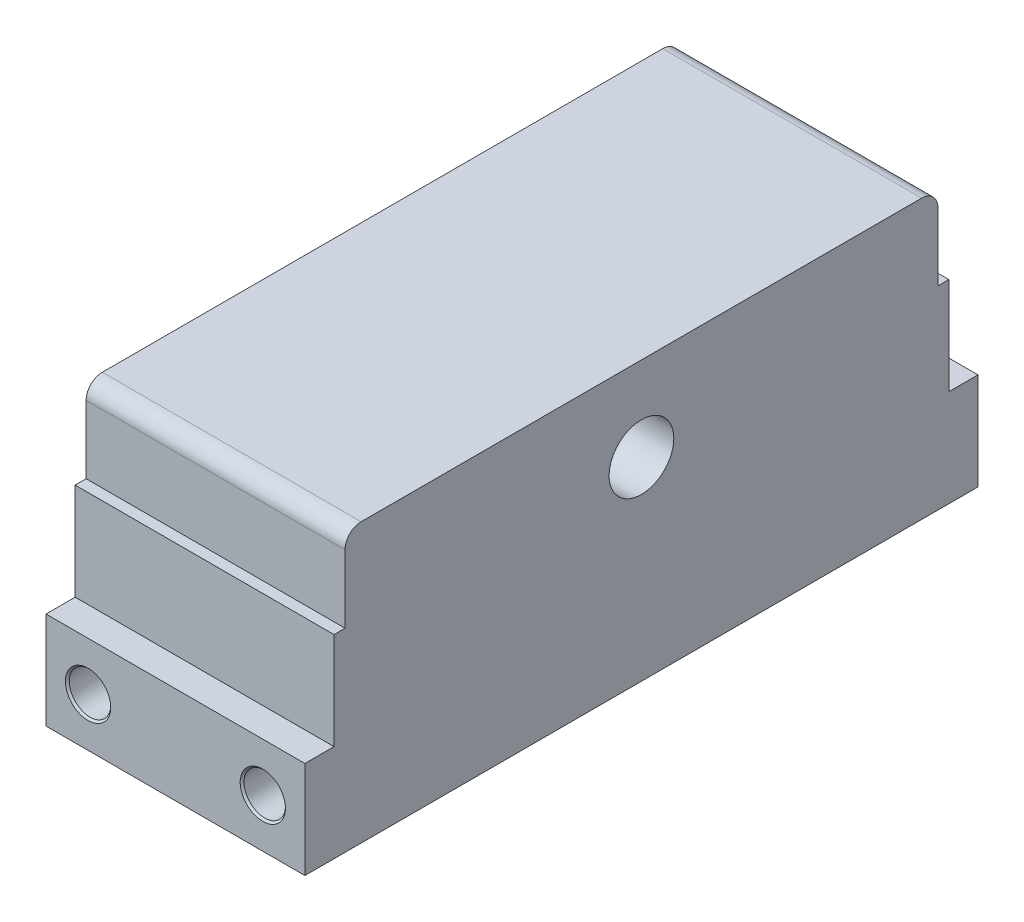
ISO-10303-21;
HEADER;
FILE_DESCRIPTION(('STEP AP214'),'2;1');
FILE_NAME('part.step','',(''),(''),'','','');
FILE_SCHEMA(('AUTOMOTIVE_DESIGN { 1 0 10303 214 1 1 1 1 }'));
ENDSEC;
DATA;
#1=APPLICATION_CONTEXT('core data for automotive mechanical design processes');
#2=APPLICATION_PROTOCOL_DEFINITION('international standard','automotive_design',2000,#1);
#3=PRODUCT_CONTEXT('',#1,'mechanical');
#4=PRODUCT('Part','Part','',(#3));
#5=PRODUCT_RELATED_PRODUCT_CATEGORY('part','',(#4));
#6=PRODUCT_DEFINITION_FORMATION('','',#4);
#7=PRODUCT_DEFINITION_CONTEXT('part definition',#1,'design');
#8=PRODUCT_DEFINITION('design','',#6,#7);
#9=PRODUCT_DEFINITION_SHAPE('','',#8);
#10=(LENGTH_UNIT() NAMED_UNIT(*) SI_UNIT(.MILLI.,.METRE.));
#11=(NAMED_UNIT(*) PLANE_ANGLE_UNIT() SI_UNIT($,.RADIAN.));
#12=(NAMED_UNIT(*) SI_UNIT($,.STERADIAN.) SOLID_ANGLE_UNIT());
#13=UNCERTAINTY_MEASURE_WITH_UNIT(LENGTH_MEASURE(1.E-05),#10,'distance_accuracy_value','');
#14=(GEOMETRIC_REPRESENTATION_CONTEXT(3) GLOBAL_UNCERTAINTY_ASSIGNED_CONTEXT((#13)) GLOBAL_UNIT_ASSIGNED_CONTEXT((#10,
#11,#12)) REPRESENTATION_CONTEXT('',''));
#15=CARTESIAN_POINT('',(0.,0.,0.));
#16=DIRECTION('',(0.,0.,1.));
#17=DIRECTION('',(1.,0.,0.));
#18=AXIS2_PLACEMENT_3D('',#15,#16,#17);
#19=CARTESIAN_POINT('',(40.,10.5,43.3000000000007));
#20=DIRECTION('',(1.,0.,0.));
#21=DIRECTION('',(0.,0.,-1.));
#22=AXIS2_PLACEMENT_3D('',#19,#20,#21);
#23=PLANE('',#22);
#24=CARTESIAN_POINT('',(40.,10.5,43.3000000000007));
#25=DIRECTION('',(1.,0.,0.));
#26=DIRECTION('',(0.,0.,-1.));
#27=AXIS2_PLACEMENT_3D('',#24,#25,#26);
#28=CIRCLE('',#27,2.49999999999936);
#29=CARTESIAN_POINT('',(40.,12.9999999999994,43.3000000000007));
#30=VERTEX_POINT('',#29);
#31=CARTESIAN_POINT('',(40.,10.5,45.8));
#32=VERTEX_POINT('',#31);
#33=EDGE_CURVE('E197',#30,#32,#28,.T.);
#34=ORIENTED_EDGE('',*,*,#33,.T.);
#35=DIRECTION('',(0.,-1.,0.));
#36=VECTOR('',#35,1.);
#37=CARTESIAN_POINT('',(40.,10.5,45.8));
#38=LINE('',#37,#36);
#39=CARTESIAN_POINT('',(40.,0.,45.8));
#40=VERTEX_POINT('',#39);
#41=EDGE_CURVE('E109',#32,#40,#38,.T.);
#42=ORIENTED_EDGE('',*,*,#41,.T.);
#43=DIRECTION('',(0.,0.,1.));
#44=VECTOR('',#43,1.);
#45=CARTESIAN_POINT('',(40.,0.,45.8));
#46=LINE('',#45,#44);
#47=CARTESIAN_POINT('',(40.,0.,47.5));
#48=VERTEX_POINT('',#47);
#49=EDGE_CURVE('E230',#40,#48,#46,.T.);
#50=ORIENTED_EDGE('',*,*,#49,.T.);
#51=DIRECTION('',(0.,-1.,0.));
#52=VECTOR('',#51,1.);
#53=CARTESIAN_POINT('',(40.,0.,47.5));
#54=LINE('',#53,#52);
#55=CARTESIAN_POINT('',(40.,-14.9999999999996,47.5));
#56=VERTEX_POINT('',#55);
#57=EDGE_CURVE('E247',#48,#56,#54,.T.);
#58=ORIENTED_EDGE('',*,*,#57,.T.);
#59=DIRECTION('',(0.,0.,1.));
#60=VECTOR('',#59,1.);
#61=CARTESIAN_POINT('',(40.,-14.9999999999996,47.5));
#62=LINE('',#61,#60);
#63=CARTESIAN_POINT('',(40.,-14.9999999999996,52.));
#64=VERTEX_POINT('',#63);
#65=EDGE_CURVE('E244',#56,#64,#62,.T.);
#66=ORIENTED_EDGE('',*,*,#65,.T.);
#67=DIRECTION('',(0.,-1.,0.));
#68=VECTOR('',#67,1.);
#69=CARTESIAN_POINT('',(40.,-14.9999999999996,52.));
#70=LINE('',#69,#68);
#71=CARTESIAN_POINT('',(40.,-30.0000000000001,52.));
#72=VERTEX_POINT('',#71);
#73=EDGE_CURVE('E246',#64,#72,#70,.T.);
#74=ORIENTED_EDGE('',*,*,#73,.T.);
#75=DIRECTION('',(0.,0.,-1.));
#76=VECTOR('',#75,1.);
#77=CARTESIAN_POINT('',(40.,-30.0000000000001,52.));
#78=LINE('',#77,#76);
#79=CARTESIAN_POINT('',(40.,-30.,-52.));
#80=VERTEX_POINT('',#79);
#81=EDGE_CURVE('E249',#72,#80,#78,.T.);
#82=ORIENTED_EDGE('',*,*,#81,.T.);
#83=DIRECTION('',(0.,1.,0.));
#84=VECTOR('',#83,1.);
#85=CARTESIAN_POINT('',(40.,-30.,-52.));
#86=LINE('',#85,#84);
#87=CARTESIAN_POINT('',(40.,-15.0000000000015,-52.));
#88=VERTEX_POINT('',#87);
#89=EDGE_CURVE('E255',#80,#88,#86,.T.);
#90=ORIENTED_EDGE('',*,*,#89,.T.);
#91=DIRECTION('',(0.,0.,1.));
#92=VECTOR('',#91,1.);
#93=CARTESIAN_POINT('',(40.,-15.0000000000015,-52.));
#94=LINE('',#93,#92);
#95=CARTESIAN_POINT('',(40.,-15.0000000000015,-47.5000000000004));
#96=VERTEX_POINT('',#95);
#97=EDGE_CURVE('E257',#88,#96,#94,.T.);
#98=ORIENTED_EDGE('',*,*,#97,.T.);
#99=DIRECTION('',(0.,1.,0.));
#100=VECTOR('',#99,1.);
#101=CARTESIAN_POINT('',(40.,-15.0000000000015,-47.5000000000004));
#102=LINE('',#101,#100);
#103=CARTESIAN_POINT('',(40.,-2.46830331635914E-12,-47.5000000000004));
#104=VERTEX_POINT('',#103);
#105=EDGE_CURVE('E259',#96,#104,#102,.T.);
#106=ORIENTED_EDGE('',*,*,#105,.T.);
#107=DIRECTION('',(0.,0.,1.));
#108=VECTOR('',#107,1.);
#109=CARTESIAN_POINT('',(40.,-2.46830331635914E-12,-47.5000000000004));
#110=LINE('',#109,#108);
#111=CARTESIAN_POINT('',(40.,-2.468511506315E-12,-45.8000000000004));
#112=VERTEX_POINT('',#111);
#113=EDGE_CURVE('E149',#104,#112,#110,.T.);
#114=ORIENTED_EDGE('',*,*,#113,.T.);
#115=DIRECTION('',(0.,1.,0.));
#116=VECTOR('',#115,1.);
#117=CARTESIAN_POINT('',(40.,-2.468511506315E-12,-45.8000000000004));
#118=LINE('',#117,#116);
#119=CARTESIAN_POINT('',(40.,10.4999999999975,-45.8000000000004));
#120=VERTEX_POINT('',#119);
#121=EDGE_CURVE('E142',#112,#120,#118,.T.);
#122=ORIENTED_EDGE('',*,*,#121,.T.);
#123=CARTESIAN_POINT('',(40.,10.4999999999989,-43.3));
#124=DIRECTION('',(1.,0.,0.));
#125=DIRECTION('',(0.,0.,1.));
#126=AXIS2_PLACEMENT_3D('',#123,#124,#125);
#127=CIRCLE('',#126,2.50000000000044);
#128=CARTESIAN_POINT('',(40.,12.9999999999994,-43.3));
#129=VERTEX_POINT('',#128);
#130=EDGE_CURVE('E146',#120,#129,#127,.T.);
#131=ORIENTED_EDGE('',*,*,#130,.T.);
#132=DIRECTION('',(0.,0.,1.));
#133=VECTOR('',#132,1.);
#134=CARTESIAN_POINT('',(40.,12.9999999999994,-43.3));
#135=LINE('',#134,#133);
#136=EDGE_CURVE('E49',#129,#30,#135,.T.);
#137=ORIENTED_EDGE('',*,*,#136,.T.);
#138=EDGE_LOOP('',(#34,#42,#50,#58,#66,#74,#82,#90,#98,#106,#114,#122,#131,#137));
#139=FACE_BOUND('',#138,.T.);
#140=CARTESIAN_POINT('',(40.,0.,0.));
#141=DIRECTION('',(1.,0.,0.));
#142=DIRECTION('',(0.,0.,-1.));
#143=AXIS2_PLACEMENT_3D('',#140,#141,#142);
#144=CIRCLE('',#143,4.99999999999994);
#145=CARTESIAN_POINT('',(40.,0.,-4.99999999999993));
#146=VERTEX_POINT('',#145);
#147=EDGE_CURVE('E173',#146,#146,#144,.T.);
#148=ORIENTED_EDGE('',*,*,#147,.F.);
#149=EDGE_LOOP('',(#148));
#150=FACE_BOUND('',#149,.T.);
#151=ADVANCED_FACE('F32',(#139,#150),#23,.T.);
#152=CARTESIAN_POINT('',(0.,10.5,43.3000000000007));
#153=DIRECTION('',(1.,0.,0.));
#154=DIRECTION('',(0.,0.,-1.));
#155=AXIS2_PLACEMENT_3D('',#152,#153,#154);
#156=PLANE('',#155);
#157=CARTESIAN_POINT('',(0.,10.5,43.3000000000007));
#158=DIRECTION('',(1.,0.,0.));
#159=DIRECTION('',(0.,0.,-1.));
#160=AXIS2_PLACEMENT_3D('',#157,#158,#159);
#161=CIRCLE('',#160,2.49999999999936);
#162=CARTESIAN_POINT('',(0.,12.9999999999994,43.3000000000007));
#163=VERTEX_POINT('',#162);
#164=CARTESIAN_POINT('',(0.,10.5,45.8));
#165=VERTEX_POINT('',#164);
#166=EDGE_CURVE('E169',#163,#165,#161,.T.);
#167=ORIENTED_EDGE('',*,*,#166,.F.);
#168=DIRECTION('',(0.,0.,1.));
#169=VECTOR('',#168,1.);
#170=CARTESIAN_POINT('',(0.,12.9999999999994,0.));
#171=LINE('',#170,#169);
#172=CARTESIAN_POINT('',(0.,12.9999999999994,-43.3));
#173=VERTEX_POINT('',#172);
#174=EDGE_CURVE('E97',#173,#163,#171,.T.);
#175=ORIENTED_EDGE('',*,*,#174,.F.);
#176=CARTESIAN_POINT('',(0.,10.4999999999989,-43.3));
#177=DIRECTION('',(1.,0.,0.));
#178=DIRECTION('',(0.,0.,1.));
#179=AXIS2_PLACEMENT_3D('',#176,#177,#178);
#180=CIRCLE('',#179,2.50000000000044);
#181=CARTESIAN_POINT('',(0.,10.4999999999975,-45.8000000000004));
#182=VERTEX_POINT('',#181);
#183=EDGE_CURVE('E194',#182,#173,#180,.T.);
#184=ORIENTED_EDGE('',*,*,#183,.F.);
#185=DIRECTION('',(0.,1.,0.));
#186=VECTOR('',#185,1.);
#187=CARTESIAN_POINT('',(0.,-2.468511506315E-12,-45.8000000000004));
#188=LINE('',#187,#186);
#189=CARTESIAN_POINT('',(0.,-2.468511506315E-12,-45.8000000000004));
#190=VERTEX_POINT('',#189);
#191=EDGE_CURVE('E158',#190,#182,#188,.T.);
#192=ORIENTED_EDGE('',*,*,#191,.F.);
#193=DIRECTION('',(0.,0.,1.));
#194=VECTOR('',#193,1.);
#195=CARTESIAN_POINT('',(0.,-2.46830331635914E-12,-47.5000000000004));
#196=LINE('',#195,#194);
#197=CARTESIAN_POINT('',(0.,-2.46830331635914E-12,-47.5000000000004));
#198=VERTEX_POINT('',#197);
#199=EDGE_CURVE('E191',#198,#190,#196,.T.);
#200=ORIENTED_EDGE('',*,*,#199,.F.);
#201=DIRECTION('',(0.,1.,0.));
#202=VECTOR('',#201,1.);
#203=CARTESIAN_POINT('',(0.,-15.0000000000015,-47.5000000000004));
#204=LINE('',#203,#202);
#205=CARTESIAN_POINT('',(0.,-15.0000000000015,-47.5000000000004));
#206=VERTEX_POINT('',#205);
#207=EDGE_CURVE('E189',#206,#198,#204,.T.);
#208=ORIENTED_EDGE('',*,*,#207,.F.);
#209=DIRECTION('',(0.,0.,1.));
#210=VECTOR('',#209,1.);
#211=CARTESIAN_POINT('',(0.,-15.0000000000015,-52.));
#212=LINE('',#211,#210);
#213=CARTESIAN_POINT('',(0.,-15.0000000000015,-52.));
#214=VERTEX_POINT('',#213);
#215=EDGE_CURVE('E187',#214,#206,#212,.T.);
#216=ORIENTED_EDGE('',*,*,#215,.F.);
#217=DIRECTION('',(0.,1.,0.));
#218=VECTOR('',#217,1.);
#219=CARTESIAN_POINT('',(0.,-30.,-52.));
#220=LINE('',#219,#218);
#221=CARTESIAN_POINT('',(0.,-30.,-52.));
#222=VERTEX_POINT('',#221);
#223=EDGE_CURVE('E185',#222,#214,#220,.T.);
#224=ORIENTED_EDGE('',*,*,#223,.F.);
#225=DIRECTION('',(0.,0.,-1.));
#226=VECTOR('',#225,1.);
#227=CARTESIAN_POINT('',(0.,-30.0000000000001,52.));
#228=LINE('',#227,#226);
#229=CARTESIAN_POINT('',(0.,-30.0000000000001,52.));
#230=VERTEX_POINT('',#229);
#231=EDGE_CURVE('E183',#230,#222,#228,.T.);
#232=ORIENTED_EDGE('',*,*,#231,.F.);
#233=DIRECTION('',(0.,-1.,0.));
#234=VECTOR('',#233,1.);
#235=CARTESIAN_POINT('',(0.,-14.9999999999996,52.));
#236=LINE('',#235,#234);
#237=CARTESIAN_POINT('',(0.,-14.9999999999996,52.));
#238=VERTEX_POINT('',#237);
#239=EDGE_CURVE('E181',#238,#230,#236,.T.);
#240=ORIENTED_EDGE('',*,*,#239,.F.);
#241=DIRECTION('',(0.,0.,1.));
#242=VECTOR('',#241,1.);
#243=CARTESIAN_POINT('',(0.,-14.9999999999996,47.5));
#244=LINE('',#243,#242);
#245=CARTESIAN_POINT('',(0.,-14.9999999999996,47.5));
#246=VERTEX_POINT('',#245);
#247=EDGE_CURVE('E179',#246,#238,#244,.T.);
#248=ORIENTED_EDGE('',*,*,#247,.F.);
#249=DIRECTION('',(0.,-1.,0.));
#250=VECTOR('',#249,1.);
#251=CARTESIAN_POINT('',(0.,0.,47.5));
#252=LINE('',#251,#250);
#253=CARTESIAN_POINT('',(0.,0.,47.5));
#254=VERTEX_POINT('',#253);
#255=EDGE_CURVE('E177',#254,#246,#252,.T.);
#256=ORIENTED_EDGE('',*,*,#255,.F.);
#257=DIRECTION('',(0.,0.,1.));
#258=VECTOR('',#257,1.);
#259=CARTESIAN_POINT('',(0.,0.,45.8));
#260=LINE('',#259,#258);
#261=CARTESIAN_POINT('',(0.,0.,45.8));
#262=VERTEX_POINT('',#261);
#263=EDGE_CURVE('E175',#262,#254,#260,.T.);
#264=ORIENTED_EDGE('',*,*,#263,.F.);
#265=DIRECTION('',(0.,-1.,0.));
#266=VECTOR('',#265,1.);
#267=CARTESIAN_POINT('',(0.,10.5,45.8));
#268=LINE('',#267,#266);
#269=EDGE_CURVE('E172',#165,#262,#268,.T.);
#270=ORIENTED_EDGE('',*,*,#269,.F.);
#271=EDGE_LOOP('',(#167,#175,#184,#192,#200,#208,#216,#224,#232,#240,#248,#256,#264,#270));
#272=FACE_BOUND('',#271,.T.);
#273=CARTESIAN_POINT('',(0.,0.,0.));
#274=DIRECTION('',(1.,0.,0.));
#275=DIRECTION('',(0.,0.,-1.));
#276=AXIS2_PLACEMENT_3D('',#273,#274,#275);
#277=CIRCLE('',#276,4.99999999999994);
#278=CARTESIAN_POINT('',(0.,0.,-4.99999999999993));
#279=VERTEX_POINT('',#278);
#280=EDGE_CURVE('E277',#279,#279,#277,.T.);
#281=ORIENTED_EDGE('',*,*,#280,.T.);
#282=EDGE_LOOP('',(#281));
#283=FACE_BOUND('',#282,.T.);
#284=ADVANCED_FACE('F232',(#272,#283),#156,.F.);
#285=CARTESIAN_POINT('',(40.,10.5,43.3000000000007));
#286=DIRECTION('',(-1.,0.,0.));
#287=DIRECTION('',(0.,0.,1.));
#288=AXIS2_PLACEMENT_3D('',#285,#286,#287);
#289=CYLINDRICAL_SURFACE('',#288,2.49999999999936);
#290=ORIENTED_EDGE('',*,*,#166,.T.);
#291=DIRECTION('',(-1.,0.,0.));
#292=VECTOR('',#291,1.);
#293=CARTESIAN_POINT('',(40.,10.5,45.8));
#294=LINE('',#293,#292);
#295=EDGE_CURVE('E11',#32,#165,#294,.T.);
#296=ORIENTED_EDGE('',*,*,#295,.F.);
#297=ORIENTED_EDGE('',*,*,#33,.F.);
#298=DIRECTION('',(-1.,0.,0.));
#299=VECTOR('',#298,1.);
#300=CARTESIAN_POINT('',(40.,12.9999999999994,43.3000000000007));
#301=LINE('',#300,#299);
#302=EDGE_CURVE('E165',#30,#163,#301,.T.);
#303=ORIENTED_EDGE('',*,*,#302,.T.);
#304=EDGE_LOOP('',(#290,#296,#297,#303));
#305=FACE_BOUND('',#304,.T.);
#306=ADVANCED_FACE('F34',(#305),#289,.T.);
#307=CARTESIAN_POINT('',(40.,10.5,45.8));
#308=DIRECTION('',(0.,0.,-1.));
#309=DIRECTION('',(-1.,0.,0.));
#310=AXIS2_PLACEMENT_3D('',#307,#308,#309);
#311=PLANE('',#310);
#312=ORIENTED_EDGE('',*,*,#269,.T.);
#313=DIRECTION('',(-1.,0.,0.));
#314=VECTOR('',#313,1.);
#315=CARTESIAN_POINT('',(40.,0.,45.8));
#316=LINE('',#315,#314);
#317=EDGE_CURVE('E41',#40,#262,#316,.T.);
#318=ORIENTED_EDGE('',*,*,#317,.F.);
#319=ORIENTED_EDGE('',*,*,#41,.F.);
#320=ORIENTED_EDGE('',*,*,#295,.T.);
#321=EDGE_LOOP('',(#312,#318,#319,#320));
#322=FACE_BOUND('',#321,.T.);
#323=ADVANCED_FACE('F564',(#322),#311,.F.);
#324=CARTESIAN_POINT('',(40.,0.,45.8));
#325=DIRECTION('',(0.,-1.,0.));
#326=DIRECTION('',(0.,0.,-1.));
#327=AXIS2_PLACEMENT_3D('',#324,#325,#326);
#328=PLANE('',#327);
#329=ORIENTED_EDGE('',*,*,#263,.T.);
#330=DIRECTION('',(-1.,0.,0.));
#331=VECTOR('',#330,1.);
#332=CARTESIAN_POINT('',(40.,0.,47.5));
#333=LINE('',#332,#331);
#334=EDGE_CURVE('E222',#48,#254,#333,.T.);
#335=ORIENTED_EDGE('',*,*,#334,.F.);
#336=ORIENTED_EDGE('',*,*,#49,.F.);
#337=ORIENTED_EDGE('',*,*,#317,.T.);
#338=EDGE_LOOP('',(#329,#335,#336,#337));
#339=FACE_BOUND('',#338,.T.);
#340=ADVANCED_FACE('F228',(#339),#328,.F.);
#341=CARTESIAN_POINT('',(40.,0.,47.5));
#342=DIRECTION('',(0.,0.,-1.));
#343=DIRECTION('',(0.,1.,0.));
#344=AXIS2_PLACEMENT_3D('',#341,#342,#343);
#345=PLANE('',#344);
#346=ORIENTED_EDGE('',*,*,#255,.T.);
#347=DIRECTION('',(-1.,0.,0.));
#348=VECTOR('',#347,1.);
#349=CARTESIAN_POINT('',(40.,-14.9999999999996,47.5));
#350=LINE('',#349,#348);
#351=EDGE_CURVE('E219',#56,#246,#350,.T.);
#352=ORIENTED_EDGE('',*,*,#351,.F.);
#353=ORIENTED_EDGE('',*,*,#57,.F.);
#354=ORIENTED_EDGE('',*,*,#334,.T.);
#355=EDGE_LOOP('',(#346,#352,#353,#354));
#356=FACE_BOUND('',#355,.T.);
#357=ADVANCED_FACE('F238',(#356),#345,.F.);
#358=CARTESIAN_POINT('',(40.,-14.9999999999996,47.5));
#359=DIRECTION('',(0.,-1.,0.));
#360=DIRECTION('',(0.,0.,-1.));
#361=AXIS2_PLACEMENT_3D('',#358,#359,#360);
#362=PLANE('',#361);
#363=ORIENTED_EDGE('',*,*,#247,.T.);
#364=DIRECTION('',(-1.,0.,0.));
#365=VECTOR('',#364,1.);
#366=CARTESIAN_POINT('',(40.,-14.9999999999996,52.));
#367=LINE('',#366,#365);
#368=EDGE_CURVE('E216',#64,#238,#367,.T.);
#369=ORIENTED_EDGE('',*,*,#368,.F.);
#370=ORIENTED_EDGE('',*,*,#65,.F.);
#371=ORIENTED_EDGE('',*,*,#351,.T.);
#372=EDGE_LOOP('',(#363,#369,#370,#371));
#373=FACE_BOUND('',#372,.T.);
#374=ADVANCED_FACE('F242',(#373),#362,.F.);
#375=CARTESIAN_POINT('',(40.,-14.9999999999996,52.));
#376=DIRECTION('',(0.,0.,-1.));
#377=DIRECTION('',(0.,1.,0.));
#378=AXIS2_PLACEMENT_3D('',#375,#376,#377);
#379=PLANE('',#378);
#380=CARTESIAN_POINT('',(6.5,-22.5,52.));
#381=DIRECTION('',(0.,0.,1.));
#382=DIRECTION('',(0.,-1.,0.));
#383=AXIS2_PLACEMENT_3D('',#380,#381,#382);
#384=CIRCLE('',#383,3.5);
#385=CARTESIAN_POINT('',(6.5,-26.,52.));
#386=VERTEX_POINT('',#385);
#387=EDGE_CURVE('E297',#386,#386,#384,.T.);
#388=ORIENTED_EDGE('',*,*,#387,.F.);
#389=EDGE_LOOP('',(#388));
#390=FACE_BOUND('',#389,.T.);
#391=CARTESIAN_POINT('',(33.5,-22.5,52.));
#392=DIRECTION('',(0.,0.,1.));
#393=DIRECTION('',(0.,-1.,0.));
#394=AXIS2_PLACEMENT_3D('',#391,#392,#393);
#395=CIRCLE('',#394,3.5);
#396=CARTESIAN_POINT('',(33.5,-26.,52.));
#397=VERTEX_POINT('',#396);
#398=EDGE_CURVE('E288',#397,#397,#395,.T.);
#399=ORIENTED_EDGE('',*,*,#398,.F.);
#400=EDGE_LOOP('',(#399));
#401=FACE_BOUND('',#400,.T.);
#402=ORIENTED_EDGE('',*,*,#239,.T.);
#403=DIRECTION('',(-1.,0.,0.));
#404=VECTOR('',#403,1.);
#405=CARTESIAN_POINT('',(40.,-30.0000000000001,52.));
#406=LINE('',#405,#404);
#407=EDGE_CURVE('E213',#72,#230,#406,.T.);
#408=ORIENTED_EDGE('',*,*,#407,.F.);
#409=ORIENTED_EDGE('',*,*,#73,.F.);
#410=ORIENTED_EDGE('',*,*,#368,.T.);
#411=EDGE_LOOP('',(#402,#408,#409,#410));
#412=FACE_BOUND('',#411,.T.);
#413=ADVANCED_FACE('F534',(#390,#401,#412),#379,.F.);
#414=CARTESIAN_POINT('',(40.,-30.0000000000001,52.));
#415=DIRECTION('',(0.,1.,0.));
#416=DIRECTION('',(0.,0.,1.));
#417=AXIS2_PLACEMENT_3D('',#414,#415,#416);
#418=PLANE('',#417);
#419=ORIENTED_EDGE('',*,*,#231,.T.);
#420=DIRECTION('',(-1.,0.,0.));
#421=VECTOR('',#420,1.);
#422=CARTESIAN_POINT('',(40.,-30.,-52.));
#423=LINE('',#422,#421);
#424=EDGE_CURVE('E210',#80,#222,#423,.T.);
#425=ORIENTED_EDGE('',*,*,#424,.F.);
#426=ORIENTED_EDGE('',*,*,#81,.F.);
#427=ORIENTED_EDGE('',*,*,#407,.T.);
#428=EDGE_LOOP('',(#419,#425,#426,#427));
#429=FACE_BOUND('',#428,.T.);
#430=ADVANCED_FACE('F325',(#429),#418,.F.);
#431=CARTESIAN_POINT('',(40.,-30.,-52.));
#432=DIRECTION('',(0.,0.,1.));
#433=DIRECTION('',(0.,-1.,0.));
#434=AXIS2_PLACEMENT_3D('',#431,#432,#433);
#435=PLANE('',#434);
#436=CARTESIAN_POINT('',(6.5,-22.5,-52.));
#437=DIRECTION('',(0.,0.,-1.));
#438=DIRECTION('',(-1.,0.,0.));
#439=AXIS2_PLACEMENT_3D('',#436,#437,#438);
#440=CIRCLE('',#439,3.5);
#441=CARTESIAN_POINT('',(3.,-22.5,-52.));
#442=VERTEX_POINT('',#441);
#443=EDGE_CURVE('E315',#442,#442,#440,.T.);
#444=ORIENTED_EDGE('',*,*,#443,.F.);
#445=EDGE_LOOP('',(#444));
#446=FACE_BOUND('',#445,.T.);
#447=CARTESIAN_POINT('',(33.5,-22.5,-52.));
#448=DIRECTION('',(0.,0.,-1.));
#449=DIRECTION('',(-1.,0.,0.));
#450=AXIS2_PLACEMENT_3D('',#447,#448,#449);
#451=CIRCLE('',#450,3.5);
#452=CARTESIAN_POINT('',(30.,-22.5,-52.));
#453=VERTEX_POINT('',#452);
#454=EDGE_CURVE('E306',#453,#453,#451,.T.);
#455=ORIENTED_EDGE('',*,*,#454,.F.);
#456=EDGE_LOOP('',(#455));
#457=FACE_BOUND('',#456,.T.);
#458=ORIENTED_EDGE('',*,*,#223,.T.);
#459=DIRECTION('',(-1.,0.,0.));
#460=VECTOR('',#459,1.);
#461=CARTESIAN_POINT('',(40.,-15.0000000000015,-52.));
#462=LINE('',#461,#460);
#463=EDGE_CURVE('E207',#88,#214,#462,.T.);
#464=ORIENTED_EDGE('',*,*,#463,.F.);
#465=ORIENTED_EDGE('',*,*,#89,.F.);
#466=ORIENTED_EDGE('',*,*,#424,.T.);
#467=EDGE_LOOP('',(#458,#464,#465,#466));
#468=FACE_BOUND('',#467,.T.);
#469=ADVANCED_FACE('F321',(#446,#457,#468),#435,.F.);
#470=CARTESIAN_POINT('',(40.,-15.0000000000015,-52.));
#471=DIRECTION('',(0.,-1.,0.));
#472=DIRECTION('',(0.,0.,-1.));
#473=AXIS2_PLACEMENT_3D('',#470,#471,#472);
#474=PLANE('',#473);
#475=ORIENTED_EDGE('',*,*,#215,.T.);
#476=DIRECTION('',(-1.,0.,0.));
#477=VECTOR('',#476,1.);
#478=CARTESIAN_POINT('',(40.,-15.0000000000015,-47.5000000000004));
#479=LINE('',#478,#477);
#480=EDGE_CURVE('E204',#96,#206,#479,.T.);
#481=ORIENTED_EDGE('',*,*,#480,.F.);
#482=ORIENTED_EDGE('',*,*,#97,.F.);
#483=ORIENTED_EDGE('',*,*,#463,.T.);
#484=EDGE_LOOP('',(#475,#481,#482,#483));
#485=FACE_BOUND('',#484,.T.);
#486=ADVANCED_FACE('F324',(#485),#474,.F.);
#487=CARTESIAN_POINT('',(40.,-15.0000000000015,-47.5000000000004));
#488=DIRECTION('',(0.,0.,1.));
#489=DIRECTION('',(1.,0.,0.));
#490=AXIS2_PLACEMENT_3D('',#487,#488,#489);
#491=PLANE('',#490);
#492=ORIENTED_EDGE('',*,*,#207,.T.);
#493=DIRECTION('',(-1.,0.,0.));
#494=VECTOR('',#493,1.);
#495=CARTESIAN_POINT('',(40.,-2.46830331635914E-12,-47.5000000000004));
#496=LINE('',#495,#494);
#497=EDGE_CURVE('E201',#104,#198,#496,.T.);
#498=ORIENTED_EDGE('',*,*,#497,.F.);
#499=ORIENTED_EDGE('',*,*,#105,.F.);
#500=ORIENTED_EDGE('',*,*,#480,.T.);
#501=EDGE_LOOP('',(#492,#498,#499,#500));
#502=FACE_BOUND('',#501,.T.);
#503=ADVANCED_FACE('F265',(#502),#491,.F.);
#504=CARTESIAN_POINT('',(40.,-2.46830331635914E-12,-47.5000000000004));
#505=DIRECTION('',(0.,-1.,0.));
#506=DIRECTION('',(0.,0.,-1.));
#507=AXIS2_PLACEMENT_3D('',#504,#505,#506);
#508=PLANE('',#507);
#509=ORIENTED_EDGE('',*,*,#199,.T.);
#510=DIRECTION('',(-1.,0.,0.));
#511=VECTOR('',#510,1.);
#512=CARTESIAN_POINT('',(40.,-2.468511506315E-12,-45.8000000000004));
#513=LINE('',#512,#511);
#514=EDGE_CURVE('E160',#112,#190,#513,.T.);
#515=ORIENTED_EDGE('',*,*,#514,.F.);
#516=ORIENTED_EDGE('',*,*,#113,.F.);
#517=ORIENTED_EDGE('',*,*,#497,.T.);
#518=EDGE_LOOP('',(#509,#515,#516,#517));
#519=FACE_BOUND('',#518,.T.);
#520=ADVANCED_FACE('F269',(#519),#508,.F.);
#521=CARTESIAN_POINT('',(40.,-2.468511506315E-12,-45.8000000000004));
#522=DIRECTION('',(0.,0.,1.));
#523=DIRECTION('',(1.,0.,0.));
#524=AXIS2_PLACEMENT_3D('',#521,#522,#523);
#525=PLANE('',#524);
#526=ORIENTED_EDGE('',*,*,#191,.T.);
#527=DIRECTION('',(-1.,0.,0.));
#528=VECTOR('',#527,1.);
#529=CARTESIAN_POINT('',(40.,10.4999999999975,-45.8000000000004));
#530=LINE('',#529,#528);
#531=EDGE_CURVE('E155',#120,#182,#530,.T.);
#532=ORIENTED_EDGE('',*,*,#531,.F.);
#533=ORIENTED_EDGE('',*,*,#121,.F.);
#534=ORIENTED_EDGE('',*,*,#514,.T.);
#535=EDGE_LOOP('',(#526,#532,#533,#534));
#536=FACE_BOUND('',#535,.T.);
#537=ADVANCED_FACE('F156',(#536),#525,.F.);
#538=CARTESIAN_POINT('',(40.,10.4999999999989,-43.3));
#539=DIRECTION('',(-1.,0.,0.));
#540=DIRECTION('',(0.,0.,1.));
#541=AXIS2_PLACEMENT_3D('',#538,#539,#540);
#542=CYLINDRICAL_SURFACE('',#541,2.50000000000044);
#543=ORIENTED_EDGE('',*,*,#183,.T.);
#544=DIRECTION('',(-1.,0.,0.));
#545=VECTOR('',#544,1.);
#546=CARTESIAN_POINT('',(40.,12.9999999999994,-43.3));
#547=LINE('',#546,#545);
#548=EDGE_CURVE('E161',#129,#173,#547,.T.);
#549=ORIENTED_EDGE('',*,*,#548,.F.);
#550=ORIENTED_EDGE('',*,*,#130,.F.);
#551=ORIENTED_EDGE('',*,*,#531,.T.);
#552=EDGE_LOOP('',(#543,#549,#550,#551));
#553=FACE_BOUND('',#552,.T.);
#554=ADVANCED_FACE('F163',(#553),#542,.T.);
#555=CARTESIAN_POINT('',(40.,12.9999999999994,0.));
#556=DIRECTION('',(0.,-1.,0.));
#557=DIRECTION('',(0.,0.,-1.));
#558=AXIS2_PLACEMENT_3D('',#555,#556,#557);
#559=PLANE('',#558);
#560=ORIENTED_EDGE('',*,*,#174,.T.);
#561=ORIENTED_EDGE('',*,*,#302,.F.);
#562=ORIENTED_EDGE('',*,*,#136,.F.);
#563=ORIENTED_EDGE('',*,*,#548,.T.);
#564=EDGE_LOOP('',(#560,#561,#562,#563));
#565=FACE_BOUND('',#564,.T.);
#566=ADVANCED_FACE('F270',(#565),#559,.F.);
#567=CARTESIAN_POINT('',(40.,0.,0.));
#568=DIRECTION('',(-1.,0.,0.));
#569=DIRECTION('',(0.,0.,1.));
#570=AXIS2_PLACEMENT_3D('',#567,#568,#569);
#571=CYLINDRICAL_SURFACE('',#570,4.99999999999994);
#572=ORIENTED_EDGE('',*,*,#147,.T.);
#573=EDGE_LOOP('',(#572));
#574=FACE_BOUND('',#573,.T.);
#575=ORIENTED_EDGE('',*,*,#280,.F.);
#576=EDGE_LOOP('',(#575));
#577=FACE_BOUND('',#576,.T.);
#578=ADVANCED_FACE('F349',(#574,#577),#571,.F.);
#579=CARTESIAN_POINT('',(33.5,-22.5,22.));
#580=DIRECTION('',(0.,0.,1.));
#581=DIRECTION('',(0.,-1.,0.));
#582=AXIS2_PLACEMENT_3D('',#579,#580,#581);
#583=CONICAL_SURFACE('',#582,3.19999999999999,1.02974425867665);
#584=CARTESIAN_POINT('',(33.5,-22.5,20.0772460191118));
#585=VERTEX_POINT('',#584);
#586=VERTEX_LOOP('',#585);
#587=FACE_BOUND('',#586,.T.);
#588=CARTESIAN_POINT('',(33.5,-22.5,22.));
#589=DIRECTION('',(0.,0.,1.));
#590=DIRECTION('',(0.,-1.,0.));
#591=AXIS2_PLACEMENT_3D('',#588,#589,#590);
#592=CIRCLE('',#591,3.19999999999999);
#593=CARTESIAN_POINT('',(33.5,-25.7,22.));
#594=VERTEX_POINT('',#593);
#595=EDGE_CURVE('E280',#594,#594,#592,.T.);
#596=ORIENTED_EDGE('',*,*,#595,.T.);
#597=EDGE_LOOP('',(#596));
#598=FACE_BOUND('',#597,.T.);
#599=ADVANCED_FACE('F381',(#587,#598),#583,.F.);
#600=CARTESIAN_POINT('',(33.5,-22.5,52.));
#601=DIRECTION('',(0.,0.,1.));
#602=DIRECTION('',(0.,-1.,0.));
#603=AXIS2_PLACEMENT_3D('',#600,#601,#602);
#604=CYLINDRICAL_SURFACE('',#603,3.19999999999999);
#605=ORIENTED_EDGE('',*,*,#595,.F.);
#606=EDGE_LOOP('',(#605));
#607=FACE_BOUND('',#606,.T.);
#608=CARTESIAN_POINT('',(33.5,-22.5,51.7));
#609=DIRECTION('',(0.,0.,1.));
#610=DIRECTION('',(0.,-1.,0.));
#611=AXIS2_PLACEMENT_3D('',#608,#609,#610);
#612=CIRCLE('',#611,3.19999999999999);
#613=CARTESIAN_POINT('',(33.5,-25.7,51.7));
#614=VERTEX_POINT('',#613);
#615=EDGE_CURVE('E285',#614,#614,#612,.T.);
#616=ORIENTED_EDGE('',*,*,#615,.T.);
#617=EDGE_LOOP('',(#616));
#618=FACE_BOUND('',#617,.T.);
#619=ADVANCED_FACE('F389',(#607,#618),#604,.F.);
#620=CARTESIAN_POINT('',(33.5,-22.5,52.));
#621=DIRECTION('',(0.,0.,1.));
#622=DIRECTION('',(0.,-1.,0.));
#623=AXIS2_PLACEMENT_3D('',#620,#621,#622);
#624=CONICAL_SURFACE('',#623,3.5,0.78539816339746);
#625=ORIENTED_EDGE('',*,*,#615,.F.);
#626=EDGE_LOOP('',(#625));
#627=FACE_BOUND('',#626,.T.);
#628=ORIENTED_EDGE('',*,*,#398,.T.);
#629=EDGE_LOOP('',(#628));
#630=FACE_BOUND('',#629,.T.);
#631=ADVANCED_FACE('F396',(#627,#630),#624,.F.);
#632=CARTESIAN_POINT('',(6.5,-22.5,22.));
#633=DIRECTION('',(0.,0.,1.));
#634=DIRECTION('',(0.,-1.,0.));
#635=AXIS2_PLACEMENT_3D('',#632,#633,#634);
#636=CONICAL_SURFACE('',#635,3.19999999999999,1.02974425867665);
#637=CARTESIAN_POINT('',(6.49999999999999,-22.5,20.0772460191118));
#638=VERTEX_POINT('',#637);
#639=VERTEX_LOOP('',#638);
#640=FACE_BOUND('',#639,.T.);
#641=CARTESIAN_POINT('',(6.5,-22.5,22.));
#642=DIRECTION('',(0.,0.,1.));
#643=DIRECTION('',(0.,-1.,0.));
#644=AXIS2_PLACEMENT_3D('',#641,#642,#643);
#645=CIRCLE('',#644,3.19999999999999);
#646=CARTESIAN_POINT('',(6.5,-25.7,22.));
#647=VERTEX_POINT('',#646);
#648=EDGE_CURVE('E291',#647,#647,#645,.T.);
#649=ORIENTED_EDGE('',*,*,#648,.T.);
#650=EDGE_LOOP('',(#649));
#651=FACE_BOUND('',#650,.T.);
#652=ADVANCED_FACE('F404',(#640,#651),#636,.F.);
#653=CARTESIAN_POINT('',(6.5,-22.5,52.));
#654=DIRECTION('',(0.,0.,1.));
#655=DIRECTION('',(0.,-1.,0.));
#656=AXIS2_PLACEMENT_3D('',#653,#654,#655);
#657=CYLINDRICAL_SURFACE('',#656,3.19999999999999);
#658=ORIENTED_EDGE('',*,*,#648,.F.);
#659=EDGE_LOOP('',(#658));
#660=FACE_BOUND('',#659,.T.);
#661=CARTESIAN_POINT('',(6.5,-22.5,51.7));
#662=DIRECTION('',(0.,0.,1.));
#663=DIRECTION('',(0.,-1.,0.));
#664=AXIS2_PLACEMENT_3D('',#661,#662,#663);
#665=CIRCLE('',#664,3.2);
#666=CARTESIAN_POINT('',(6.5,-25.7,51.7));
#667=VERTEX_POINT('',#666);
#668=EDGE_CURVE('E294',#667,#667,#665,.T.);
#669=ORIENTED_EDGE('',*,*,#668,.T.);
#670=EDGE_LOOP('',(#669));
#671=FACE_BOUND('',#670,.T.);
#672=ADVANCED_FACE('F412',(#660,#671),#657,.F.);
#673=CARTESIAN_POINT('',(6.5,-22.5,52.));
#674=DIRECTION('',(0.,0.,1.));
#675=DIRECTION('',(0.,-1.,0.));
#676=AXIS2_PLACEMENT_3D('',#673,#674,#675);
#677=CONICAL_SURFACE('',#676,3.5,0.785398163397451);
#678=ORIENTED_EDGE('',*,*,#668,.F.);
#679=EDGE_LOOP('',(#678));
#680=FACE_BOUND('',#679,.T.);
#681=ORIENTED_EDGE('',*,*,#387,.T.);
#682=EDGE_LOOP('',(#681));
#683=FACE_BOUND('',#682,.T.);
#684=ADVANCED_FACE('F420',(#680,#683),#677,.F.);
#685=CARTESIAN_POINT('',(33.5,-22.5,-22.));
#686=DIRECTION('',(0.,0.,-1.));
#687=DIRECTION('',(-1.,0.,0.));
#688=AXIS2_PLACEMENT_3D('',#685,#686,#687);
#689=CONICAL_SURFACE('',#688,3.19999999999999,1.02974425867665);
#690=CARTESIAN_POINT('',(33.5,-22.5,-20.0772460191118));
#691=VERTEX_POINT('',#690);
#692=VERTEX_LOOP('',#691);
#693=FACE_BOUND('',#692,.T.);
#694=CARTESIAN_POINT('',(33.5,-22.5,-22.));
#695=DIRECTION('',(0.,0.,-1.));
#696=DIRECTION('',(-1.,0.,0.));
#697=AXIS2_PLACEMENT_3D('',#694,#695,#696);
#698=CIRCLE('',#697,3.19999999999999);
#699=CARTESIAN_POINT('',(30.3,-22.5,-22.));
#700=VERTEX_POINT('',#699);
#701=EDGE_CURVE('E300',#700,#700,#698,.T.);
#702=ORIENTED_EDGE('',*,*,#701,.T.);
#703=EDGE_LOOP('',(#702));
#704=FACE_BOUND('',#703,.T.);
#705=ADVANCED_FACE('F428',(#693,#704),#689,.F.);
#706=CARTESIAN_POINT('',(33.5,-22.5,-52.));
#707=DIRECTION('',(0.,0.,-1.));
#708=DIRECTION('',(-1.,0.,0.));
#709=AXIS2_PLACEMENT_3D('',#706,#707,#708);
#710=CYLINDRICAL_SURFACE('',#709,3.19999999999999);
#711=ORIENTED_EDGE('',*,*,#701,.F.);
#712=EDGE_LOOP('',(#711));
#713=FACE_BOUND('',#712,.T.);
#714=CARTESIAN_POINT('',(33.5,-22.5,-51.7));
#715=DIRECTION('',(0.,0.,-1.));
#716=DIRECTION('',(-1.,0.,0.));
#717=AXIS2_PLACEMENT_3D('',#714,#715,#716);
#718=CIRCLE('',#717,3.19999999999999);
#719=CARTESIAN_POINT('',(30.3,-22.5,-51.7));
#720=VERTEX_POINT('',#719);
#721=EDGE_CURVE('E303',#720,#720,#718,.T.);
#722=ORIENTED_EDGE('',*,*,#721,.T.);
#723=EDGE_LOOP('',(#722));
#724=FACE_BOUND('',#723,.T.);
#725=ADVANCED_FACE('F436',(#713,#724),#710,.F.);
#726=CARTESIAN_POINT('',(33.5,-22.5,-52.));
#727=DIRECTION('',(0.,0.,-1.));
#728=DIRECTION('',(-1.,0.,0.));
#729=AXIS2_PLACEMENT_3D('',#726,#727,#728);
#730=CONICAL_SURFACE('',#729,3.5,0.785398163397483);
#731=ORIENTED_EDGE('',*,*,#721,.F.);
#732=EDGE_LOOP('',(#731));
#733=FACE_BOUND('',#732,.T.);
#734=ORIENTED_EDGE('',*,*,#454,.T.);
#735=EDGE_LOOP('',(#734));
#736=FACE_BOUND('',#735,.T.);
#737=ADVANCED_FACE('F444',(#733,#736),#730,.F.);
#738=CARTESIAN_POINT('',(6.5,-22.5,-22.));
#739=DIRECTION('',(0.,0.,-1.));
#740=DIRECTION('',(-1.,0.,0.));
#741=AXIS2_PLACEMENT_3D('',#738,#739,#740);
#742=CONICAL_SURFACE('',#741,3.19999999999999,1.02974425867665);
#743=CARTESIAN_POINT('',(6.49999999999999,-22.5,-20.0772460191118));
#744=VERTEX_POINT('',#743);
#745=VERTEX_LOOP('',#744);
#746=FACE_BOUND('',#745,.T.);
#747=CARTESIAN_POINT('',(6.5,-22.5,-22.));
#748=DIRECTION('',(0.,0.,-1.));
#749=DIRECTION('',(-1.,0.,0.));
#750=AXIS2_PLACEMENT_3D('',#747,#748,#749);
#751=CIRCLE('',#750,3.19999999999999);
#752=CARTESIAN_POINT('',(3.30000000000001,-22.5,-22.));
#753=VERTEX_POINT('',#752);
#754=EDGE_CURVE('E309',#753,#753,#751,.T.);
#755=ORIENTED_EDGE('',*,*,#754,.T.);
#756=EDGE_LOOP('',(#755));
#757=FACE_BOUND('',#756,.T.);
#758=ADVANCED_FACE('F452',(#746,#757),#742,.F.);
#759=CARTESIAN_POINT('',(6.5,-22.5,-52.));
#760=DIRECTION('',(0.,0.,-1.));
#761=DIRECTION('',(-1.,0.,0.));
#762=AXIS2_PLACEMENT_3D('',#759,#760,#761);
#763=CYLINDRICAL_SURFACE('',#762,3.19999999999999);
#764=ORIENTED_EDGE('',*,*,#754,.F.);
#765=EDGE_LOOP('',(#764));
#766=FACE_BOUND('',#765,.T.);
#767=CARTESIAN_POINT('',(6.5,-22.5,-51.7));
#768=DIRECTION('',(0.,0.,-1.));
#769=DIRECTION('',(-1.,0.,0.));
#770=AXIS2_PLACEMENT_3D('',#767,#768,#769);
#771=CIRCLE('',#770,3.19999999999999);
#772=CARTESIAN_POINT('',(3.30000000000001,-22.5,-51.7));
#773=VERTEX_POINT('',#772);
#774=EDGE_CURVE('E312',#773,#773,#771,.T.);
#775=ORIENTED_EDGE('',*,*,#774,.T.);
#776=EDGE_LOOP('',(#775));
#777=FACE_BOUND('',#776,.T.);
#778=ADVANCED_FACE('F461',(#766,#777),#763,.F.);
#779=CARTESIAN_POINT('',(6.5,-22.5,-52.));
#780=DIRECTION('',(0.,0.,-1.));
#781=DIRECTION('',(-1.,0.,0.));
#782=AXIS2_PLACEMENT_3D('',#779,#780,#781);
#783=CONICAL_SURFACE('',#782,3.5,0.785398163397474);
#784=ORIENTED_EDGE('',*,*,#774,.F.);
#785=EDGE_LOOP('',(#784));
#786=FACE_BOUND('',#785,.T.);
#787=ORIENTED_EDGE('',*,*,#443,.T.);
#788=EDGE_LOOP('',(#787));
#789=FACE_BOUND('',#788,.T.);
#790=ADVANCED_FACE('F319',(#786,#789),#783,.F.);
#791=CLOSED_SHELL('',(#151,#284,#306,#323,#340,#357,#374,#413,#430,#469,#486,#503,#520,#537,
#554,#566,#578,#599,#619,#631,#652,#672,#684,#705,#725,#737,#758,#778,#790));
#792=MANIFOLD_SOLID_BREP('B2',#791);
#793=ADVANCED_BREP_SHAPE_REPRESENTATION('',(#18,#792),#14);
#794=SHAPE_DEFINITION_REPRESENTATION(#9,#793);
ENDSEC;
END-ISO-10303-21;
